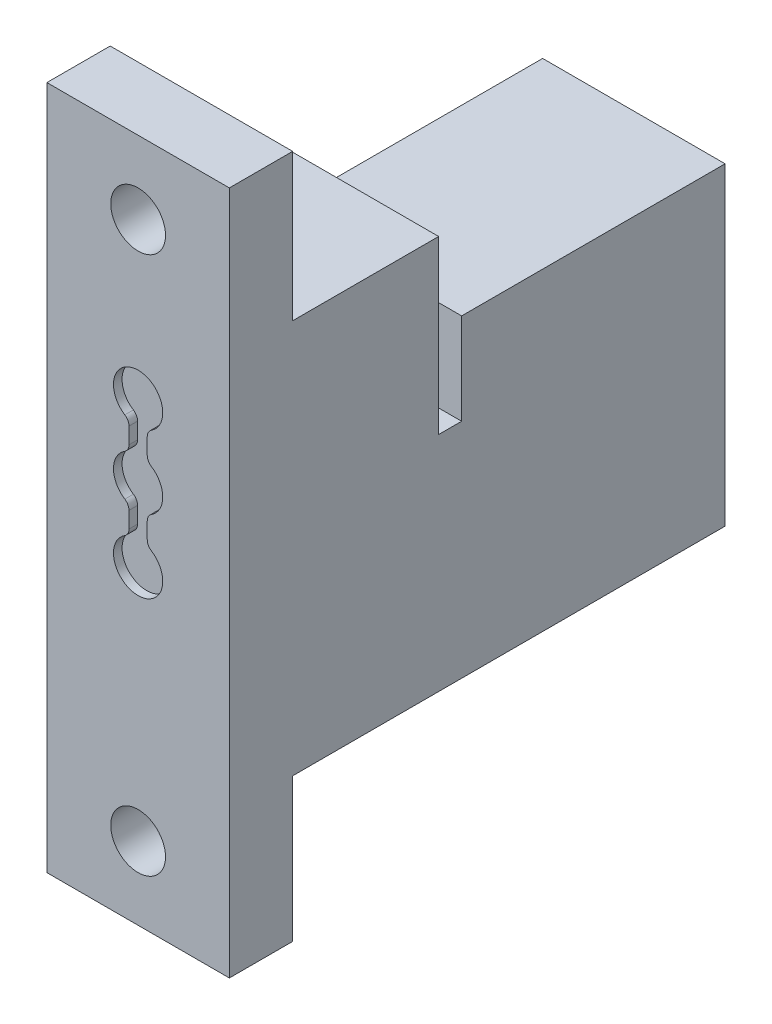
ISO-10303-21;
HEADER;
FILE_DESCRIPTION(('STEP AP214'),'2;1');
FILE_NAME('part.step','',(''),(''),'','','');
FILE_SCHEMA(('AUTOMOTIVE_DESIGN { 1 0 10303 214 1 1 1 1 }'));
ENDSEC;
DATA;
#1=APPLICATION_CONTEXT('core data for automotive mechanical design processes');
#2=APPLICATION_PROTOCOL_DEFINITION('international standard','automotive_design',2000,#1);
#3=PRODUCT_CONTEXT('',#1,'mechanical');
#4=PRODUCT('Part','Part','',(#3));
#5=PRODUCT_RELATED_PRODUCT_CATEGORY('part','',(#4));
#6=PRODUCT_DEFINITION_FORMATION('','',#4);
#7=PRODUCT_DEFINITION_CONTEXT('part definition',#1,'design');
#8=PRODUCT_DEFINITION('design','',#6,#7);
#9=PRODUCT_DEFINITION_SHAPE('','',#8);
#10=(LENGTH_UNIT() NAMED_UNIT(*) SI_UNIT(.MILLI.,.METRE.));
#11=(NAMED_UNIT(*) PLANE_ANGLE_UNIT() SI_UNIT($,.RADIAN.));
#12=(NAMED_UNIT(*) SI_UNIT($,.STERADIAN.) SOLID_ANGLE_UNIT());
#13=UNCERTAINTY_MEASURE_WITH_UNIT(LENGTH_MEASURE(1.E-05),#10,'distance_accuracy_value','');
#14=(GEOMETRIC_REPRESENTATION_CONTEXT(3) GLOBAL_UNCERTAINTY_ASSIGNED_CONTEXT((#13)) GLOBAL_UNIT_ASSIGNED_CONTEXT((#10,
#11,#12)) REPRESENTATION_CONTEXT('',''));
#15=CARTESIAN_POINT('',(0.,0.,0.));
#16=DIRECTION('',(0.,0.,1.));
#17=DIRECTION('',(1.,0.,0.));
#18=AXIS2_PLACEMENT_3D('',#15,#16,#17);
#19=CARTESIAN_POINT('',(-5.,-17.,-3.47));
#20=DIRECTION('',(0.,0.,1.));
#21=DIRECTION('',(1.,0.,0.));
#22=AXIS2_PLACEMENT_3D('',#19,#20,#21);
#23=PLANE('',#22);
#24=CARTESIAN_POINT('',(0.,16.5,-3.47));
#25=DIRECTION('',(0.,0.,1.));
#26=DIRECTION('',(1.,0.,0.));
#27=AXIS2_PLACEMENT_3D('',#24,#25,#26);
#28=CIRCLE('',#27,1.5);
#29=CARTESIAN_POINT('',(1.5,16.5,-3.47));
#30=VERTEX_POINT('',#29);
#31=EDGE_CURVE('E454',#30,#30,#28,.T.);
#32=ORIENTED_EDGE('',*,*,#31,.T.);
#33=EDGE_LOOP('',(#32));
#34=FACE_BOUND('',#33,.T.);
#35=DIRECTION('',(1.,0.,0.));
#36=VECTOR('',#35,1.);
#37=CARTESIAN_POINT('',(5.00000000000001,12.46,-3.47));
#38=LINE('',#37,#36);
#39=CARTESIAN_POINT('',(-5.,12.46,-3.47));
#40=VERTEX_POINT('',#39);
#41=CARTESIAN_POINT('',(5.,12.46,-3.47));
#42=VERTEX_POINT('',#41);
#43=EDGE_CURVE('E395',#40,#42,#38,.T.);
#44=ORIENTED_EDGE('',*,*,#43,.F.);
#45=DIRECTION('',(0.,-1.,0.));
#46=VECTOR('',#45,1.);
#47=CARTESIAN_POINT('',(-5.,20.5,-3.47));
#48=LINE('',#47,#46);
#49=CARTESIAN_POINT('',(-5.,20.5,-3.47));
#50=VERTEX_POINT('',#49);
#51=EDGE_CURVE('E467',#50,#40,#48,.T.);
#52=ORIENTED_EDGE('',*,*,#51,.F.);
#53=DIRECTION('',(-1.,0.,0.));
#54=VECTOR('',#53,1.);
#55=CARTESIAN_POINT('',(-5.,20.5,-3.47));
#56=LINE('',#55,#54);
#57=CARTESIAN_POINT('',(5.,20.5,-3.47));
#58=VERTEX_POINT('',#57);
#59=EDGE_CURVE('E473',#58,#50,#56,.T.);
#60=ORIENTED_EDGE('',*,*,#59,.F.);
#61=DIRECTION('',(0.,1.,0.));
#62=VECTOR('',#61,1.);
#63=CARTESIAN_POINT('',(5.,20.5,-3.47));
#64=LINE('',#63,#62);
#65=EDGE_CURVE('E62',#42,#58,#64,.T.);
#66=ORIENTED_EDGE('',*,*,#65,.F.);
#67=EDGE_LOOP('',(#44,#52,#60,#66));
#68=FACE_BOUND('',#67,.T.);
#69=ADVANCED_FACE('F37',(#34,#68),#23,.F.);
#70=CARTESIAN_POINT('',(0.,-13.,-3.47));
#71=DIRECTION('',(0.,0.,1.));
#72=DIRECTION('',(1.,0.,0.));
#73=AXIS2_PLACEMENT_3D('',#70,#71,#72);
#74=CIRCLE('',#73,1.5);
#75=CARTESIAN_POINT('',(1.5,-13.,-3.47));
#76=VERTEX_POINT('',#75);
#77=EDGE_CURVE('E427',#76,#76,#74,.T.);
#78=ORIENTED_EDGE('',*,*,#77,.T.);
#79=EDGE_LOOP('',(#78));
#80=FACE_BOUND('',#79,.T.);
#81=DIRECTION('',(-1.,0.,0.));
#82=VECTOR('',#81,1.);
#83=CARTESIAN_POINT('',(5.,-9.14,-3.47));
#84=LINE('',#83,#82);
#85=CARTESIAN_POINT('',(5.,-9.14,-3.47));
#86=VERTEX_POINT('',#85);
#87=CARTESIAN_POINT('',(-5.,-9.14,-3.47));
#88=VERTEX_POINT('',#87);
#89=EDGE_CURVE('E405',#86,#88,#84,.T.);
#90=ORIENTED_EDGE('',*,*,#89,.F.);
#91=CARTESIAN_POINT('',(5.,-17.,-3.47));
#92=VERTEX_POINT('',#91);
#93=EDGE_CURVE('E488',#92,#86,#64,.T.);
#94=ORIENTED_EDGE('',*,*,#93,.F.);
#95=DIRECTION('',(1.,0.,0.));
#96=VECTOR('',#95,1.);
#97=CARTESIAN_POINT('',(-5.,-17.,-3.47));
#98=LINE('',#97,#96);
#99=CARTESIAN_POINT('',(-5.,-17.,-3.47));
#100=VERTEX_POINT('',#99);
#101=EDGE_CURVE('E462',#100,#92,#98,.T.);
#102=ORIENTED_EDGE('',*,*,#101,.F.);
#103=EDGE_CURVE('E465',#88,#100,#48,.T.);
#104=ORIENTED_EDGE('',*,*,#103,.F.);
#105=EDGE_LOOP('',(#90,#94,#102,#104));
#106=FACE_BOUND('',#105,.T.);
#107=ADVANCED_FACE('F503',(#80,#106),#23,.F.);
#108=CARTESIAN_POINT('',(-5.,20.5,-3.47));
#109=DIRECTION('',(-1.,0.,0.));
#110=DIRECTION('',(0.,0.,1.));
#111=AXIS2_PLACEMENT_3D('',#108,#109,#110);
#112=PLANE('',#111);
#113=DIRECTION('',(0.,1.,0.));
#114=VECTOR('',#113,1.);
#115=CARTESIAN_POINT('',(-5.,3.06,-12.73));
#116=LINE('',#115,#114);
#117=CARTESIAN_POINT('',(-5.,3.06,-12.73));
#118=VERTEX_POINT('',#117);
#119=CARTESIAN_POINT('',(-5.,8.06,-12.73));
#120=VERTEX_POINT('',#119);
#121=EDGE_CURVE('E371',#118,#120,#116,.T.);
#122=ORIENTED_EDGE('',*,*,#121,.T.);
#123=DIRECTION('',(0.,0.,1.));
#124=VECTOR('',#123,1.);
#125=CARTESIAN_POINT('',(-5.,8.06,-27.17));
#126=LINE('',#125,#124);
#127=CARTESIAN_POINT('',(-5.,8.06,-27.17));
#128=VERTEX_POINT('',#127);
#129=EDGE_CURVE('E402',#128,#120,#126,.T.);
#130=ORIENTED_EDGE('',*,*,#129,.F.);
#131=DIRECTION('',(0.,1.,0.));
#132=VECTOR('',#131,1.);
#133=CARTESIAN_POINT('',(-5.,8.06,-27.17));
#134=LINE('',#133,#132);
#135=CARTESIAN_POINT('',(-5.,-9.14,-27.17));
#136=VERTEX_POINT('',#135);
#137=EDGE_CURVE('E381',#136,#128,#134,.T.);
#138=ORIENTED_EDGE('',*,*,#137,.F.);
#139=DIRECTION('',(0.,0.,1.));
#140=VECTOR('',#139,1.);
#141=CARTESIAN_POINT('',(-5.,-9.14,-11.47));
#142=LINE('',#141,#140);
#143=EDGE_CURVE('E421',#136,#88,#142,.T.);
#144=ORIENTED_EDGE('',*,*,#143,.T.);
#145=ORIENTED_EDGE('',*,*,#103,.T.);
#146=DIRECTION('',(0.,0.,1.));
#147=VECTOR('',#146,1.);
#148=CARTESIAN_POINT('',(-5.,-17.,-3.47));
#149=LINE('',#148,#147);
#150=CARTESIAN_POINT('',(-5.,-17.,0.));
#151=VERTEX_POINT('',#150);
#152=EDGE_CURVE('E470',#100,#151,#149,.T.);
#153=ORIENTED_EDGE('',*,*,#152,.T.);
#154=DIRECTION('',(0.,-1.,0.));
#155=VECTOR('',#154,1.);
#156=CARTESIAN_POINT('',(-5.,20.5,0.));
#157=LINE('',#156,#155);
#158=CARTESIAN_POINT('',(-5.,20.5,0.));
#159=VERTEX_POINT('',#158);
#160=EDGE_CURVE('E457',#159,#151,#157,.T.);
#161=ORIENTED_EDGE('',*,*,#160,.F.);
#162=DIRECTION('',(0.,0.,1.));
#163=VECTOR('',#162,1.);
#164=CARTESIAN_POINT('',(-5.,20.5,-3.47));
#165=LINE('',#164,#163);
#166=EDGE_CURVE('E11',#50,#159,#165,.T.);
#167=ORIENTED_EDGE('',*,*,#166,.F.);
#168=ORIENTED_EDGE('',*,*,#51,.T.);
#169=DIRECTION('',(0.,0.,1.));
#170=VECTOR('',#169,1.);
#171=CARTESIAN_POINT('',(-5.,12.46,-11.47));
#172=LINE('',#171,#170);
#173=CARTESIAN_POINT('',(-5.,12.46,-11.47));
#174=VERTEX_POINT('',#173);
#175=EDGE_CURVE('E436',#174,#40,#172,.T.);
#176=ORIENTED_EDGE('',*,*,#175,.F.);
#177=DIRECTION('',(0.,1.,0.));
#178=VECTOR('',#177,1.);
#179=CARTESIAN_POINT('',(-5.,12.46,-11.47));
#180=LINE('',#179,#178);
#181=CARTESIAN_POINT('',(-5.,3.06,-11.47));
#182=VERTEX_POINT('',#181);
#183=EDGE_CURVE('E394',#182,#174,#180,.T.);
#184=ORIENTED_EDGE('',*,*,#183,.F.);
#185=DIRECTION('',(0.,0.,1.));
#186=VECTOR('',#185,1.);
#187=CARTESIAN_POINT('',(-5.,3.06,-12.73));
#188=LINE('',#187,#186);
#189=EDGE_CURVE('E358',#118,#182,#188,.T.);
#190=ORIENTED_EDGE('',*,*,#189,.F.);
#191=EDGE_LOOP('',(#122,#130,#138,#144,#145,#153,#161,#167,#168,#176,#184,#190));
#192=FACE_BOUND('',#191,.T.);
#193=ADVANCED_FACE('F39',(#192),#112,.T.);
#194=CARTESIAN_POINT('',(-5.,20.5,-3.47));
#195=DIRECTION('',(0.,1.,0.));
#196=DIRECTION('',(0.,0.,1.));
#197=AXIS2_PLACEMENT_3D('',#194,#195,#196);
#198=PLANE('',#197);
#199=DIRECTION('',(-1.,0.,0.));
#200=VECTOR('',#199,1.);
#201=CARTESIAN_POINT('',(-5.,20.5,0.));
#202=LINE('',#201,#200);
#203=CARTESIAN_POINT('',(5.,20.5,0.));
#204=VERTEX_POINT('',#203);
#205=EDGE_CURVE('E476',#204,#159,#202,.T.);
#206=ORIENTED_EDGE('',*,*,#205,.F.);
#207=DIRECTION('',(0.,0.,1.));
#208=VECTOR('',#207,1.);
#209=CARTESIAN_POINT('',(5.,20.5,-3.47));
#210=LINE('',#209,#208);
#211=EDGE_CURVE('E46',#58,#204,#210,.T.);
#212=ORIENTED_EDGE('',*,*,#211,.F.);
#213=ORIENTED_EDGE('',*,*,#59,.T.);
#214=ORIENTED_EDGE('',*,*,#166,.T.);
#215=EDGE_LOOP('',(#206,#212,#213,#214));
#216=FACE_BOUND('',#215,.T.);
#217=ADVANCED_FACE('F509',(#216),#198,.T.);
#218=CARTESIAN_POINT('',(5.,20.5,-3.47));
#219=DIRECTION('',(1.,0.,0.));
#220=DIRECTION('',(0.,0.,-1.));
#221=AXIS2_PLACEMENT_3D('',#218,#219,#220);
#222=PLANE('',#221);
#223=DIRECTION('',(0.,1.,0.));
#224=VECTOR('',#223,1.);
#225=CARTESIAN_POINT('',(5.00000000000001,3.06,-12.73));
#226=LINE('',#225,#224);
#227=CARTESIAN_POINT('',(5.00000000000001,3.06,-12.73));
#228=VERTEX_POINT('',#227);
#229=CARTESIAN_POINT('',(5.00000000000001,8.06,-12.73));
#230=VERTEX_POINT('',#229);
#231=EDGE_CURVE('E369',#228,#230,#226,.T.);
#232=ORIENTED_EDGE('',*,*,#231,.F.);
#233=DIRECTION('',(0.,0.,-1.));
#234=VECTOR('',#233,1.);
#235=CARTESIAN_POINT('',(5.00000000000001,3.06,-12.73));
#236=LINE('',#235,#234);
#237=CARTESIAN_POINT('',(5.00000000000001,3.06,-11.47));
#238=VERTEX_POINT('',#237);
#239=EDGE_CURVE('E364',#238,#228,#236,.T.);
#240=ORIENTED_EDGE('',*,*,#239,.F.);
#241=DIRECTION('',(0.,-1.,0.));
#242=VECTOR('',#241,1.);
#243=CARTESIAN_POINT('',(5.00000000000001,12.46,-11.47));
#244=LINE('',#243,#242);
#245=CARTESIAN_POINT('',(5.00000000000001,12.46,-11.47));
#246=VERTEX_POINT('',#245);
#247=EDGE_CURVE('E391',#246,#238,#244,.T.);
#248=ORIENTED_EDGE('',*,*,#247,.F.);
#249=DIRECTION('',(0.,0.,1.));
#250=VECTOR('',#249,1.);
#251=CARTESIAN_POINT('',(5.00000000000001,12.46,-11.47));
#252=LINE('',#251,#250);
#253=EDGE_CURVE('E433',#246,#42,#252,.T.);
#254=ORIENTED_EDGE('',*,*,#253,.T.);
#255=ORIENTED_EDGE('',*,*,#65,.T.);
#256=ORIENTED_EDGE('',*,*,#211,.T.);
#257=DIRECTION('',(0.,1.,0.));
#258=VECTOR('',#257,1.);
#259=CARTESIAN_POINT('',(5.,20.5,0.));
#260=LINE('',#259,#258);
#261=CARTESIAN_POINT('',(5.,-17.,0.));
#262=VERTEX_POINT('',#261);
#263=EDGE_CURVE('E479',#262,#204,#260,.T.);
#264=ORIENTED_EDGE('',*,*,#263,.F.);
#265=DIRECTION('',(0.,0.,1.));
#266=VECTOR('',#265,1.);
#267=CARTESIAN_POINT('',(5.,-17.,-3.47));
#268=LINE('',#267,#266);
#269=EDGE_CURVE('E472',#92,#262,#268,.T.);
#270=ORIENTED_EDGE('',*,*,#269,.F.);
#271=ORIENTED_EDGE('',*,*,#93,.T.);
#272=DIRECTION('',(0.,0.,1.));
#273=VECTOR('',#272,1.);
#274=CARTESIAN_POINT('',(5.,-9.14,-11.47));
#275=LINE('',#274,#273);
#276=CARTESIAN_POINT('',(5.,-9.14,-27.17));
#277=VERTEX_POINT('',#276);
#278=EDGE_CURVE('E442',#277,#86,#275,.T.);
#279=ORIENTED_EDGE('',*,*,#278,.F.);
#280=DIRECTION('',(0.,-1.,0.));
#281=VECTOR('',#280,1.);
#282=CARTESIAN_POINT('',(5.00000000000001,8.06,-27.17));
#283=LINE('',#282,#281);
#284=CARTESIAN_POINT('',(5.00000000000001,8.06,-27.17));
#285=VERTEX_POINT('',#284);
#286=EDGE_CURVE('E374',#285,#277,#283,.T.);
#287=ORIENTED_EDGE('',*,*,#286,.F.);
#288=DIRECTION('',(0.,0.,1.));
#289=VECTOR('',#288,1.);
#290=CARTESIAN_POINT('',(5.00000000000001,8.06,-27.17));
#291=LINE('',#290,#289);
#292=EDGE_CURVE('E385',#285,#230,#291,.T.);
#293=ORIENTED_EDGE('',*,*,#292,.T.);
#294=EDGE_LOOP('',(#232,#240,#248,#254,#255,#256,#264,#270,#271,#279,#287,#293));
#295=FACE_BOUND('',#294,.T.);
#296=ADVANCED_FACE('F515',(#295),#222,.T.);
#297=CARTESIAN_POINT('',(-5.,-17.,-3.47));
#298=DIRECTION('',(0.,-1.,0.));
#299=DIRECTION('',(0.,0.,-1.));
#300=AXIS2_PLACEMENT_3D('',#297,#298,#299);
#301=PLANE('',#300);
#302=DIRECTION('',(1.,0.,0.));
#303=VECTOR('',#302,1.);
#304=CARTESIAN_POINT('',(-5.,-17.,0.));
#305=LINE('',#304,#303);
#306=EDGE_CURVE('E482',#151,#262,#305,.T.);
#307=ORIENTED_EDGE('',*,*,#306,.F.);
#308=ORIENTED_EDGE('',*,*,#152,.F.);
#309=ORIENTED_EDGE('',*,*,#101,.T.);
#310=ORIENTED_EDGE('',*,*,#269,.T.);
#311=EDGE_LOOP('',(#307,#308,#309,#310));
#312=FACE_BOUND('',#311,.T.);
#313=ADVANCED_FACE('F500',(#312),#301,.T.);
#314=CARTESIAN_POINT('',(-5.,-17.,0.));
#315=DIRECTION('',(0.,0.,1.));
#316=DIRECTION('',(1.,0.,0.));
#317=AXIS2_PLACEMENT_3D('',#314,#315,#316);
#318=PLANE('',#317);
#319=CARTESIAN_POINT('',(1.,6.44356175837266,0.));
#320=DIRECTION('',(0.,0.,-1.));
#321=DIRECTION('',(1.,0.,0.));
#322=AXIS2_PLACEMENT_3D('',#319,#320,#321);
#323=CIRCLE('',#322,0.5);
#324=CARTESIAN_POINT('',(0.5,6.44356175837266,0.));
#325=VERTEX_POINT('',#324);
#326=CARTESIAN_POINT('',(0.729729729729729,6.86422074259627,0.));
#327=VERTEX_POINT('',#326);
#328=EDGE_CURVE('E54',#325,#327,#323,.T.);
#329=ORIENTED_EDGE('',*,*,#328,.F.);
#330=DIRECTION('',(0.,1.,0.));
#331=VECTOR('',#330,1.);
#332=CARTESIAN_POINT('',(0.5,6.44356175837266,0.));
#333=LINE('',#332,#331);
#334=CARTESIAN_POINT('',(0.5,5.55643824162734,0.));
#335=VERTEX_POINT('',#334);
#336=EDGE_CURVE('E244',#335,#325,#333,.T.);
#337=ORIENTED_EDGE('',*,*,#336,.F.);
#338=CARTESIAN_POINT('',(1.,5.55643824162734,0.));
#339=DIRECTION('',(0.,0.,-1.));
#340=DIRECTION('',(1.,0.,0.));
#341=AXIS2_PLACEMENT_3D('',#338,#339,#340);
#342=CIRCLE('',#341,0.5);
#343=CARTESIAN_POINT('',(0.72972972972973,5.13577925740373,0.));
#344=VERTEX_POINT('',#343);
#345=EDGE_CURVE('E247',#344,#335,#342,.T.);
#346=ORIENTED_EDGE('',*,*,#345,.F.);
#347=CARTESIAN_POINT('',(0.,4.,0.));
#348=DIRECTION('',(0.,0.,1.));
#349=DIRECTION('',(1.,0.,0.));
#350=AXIS2_PLACEMENT_3D('',#347,#348,#349);
#351=CIRCLE('',#350,1.35);
#352=CARTESIAN_POINT('',(0.72972972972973,2.86422074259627,0.));
#353=VERTEX_POINT('',#352);
#354=EDGE_CURVE('E323',#353,#344,#351,.T.);
#355=ORIENTED_EDGE('',*,*,#354,.F.);
#356=CARTESIAN_POINT('',(1.,2.44356175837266,0.));
#357=DIRECTION('',(0.,0.,-1.));
#358=DIRECTION('',(1.,0.,0.));
#359=AXIS2_PLACEMENT_3D('',#356,#357,#358);
#360=CIRCLE('',#359,0.5);
#361=CARTESIAN_POINT('',(0.500000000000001,2.44356175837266,0.));
#362=VERTEX_POINT('',#361);
#363=EDGE_CURVE('E320',#362,#353,#360,.T.);
#364=ORIENTED_EDGE('',*,*,#363,.F.);
#365=DIRECTION('',(0.,1.,0.));
#366=VECTOR('',#365,1.);
#367=CARTESIAN_POINT('',(0.500000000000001,2.44356175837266,0.));
#368=LINE('',#367,#366);
#369=CARTESIAN_POINT('',(0.500000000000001,1.55643824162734,0.));
#370=VERTEX_POINT('',#369);
#371=EDGE_CURVE('E317',#370,#362,#368,.T.);
#372=ORIENTED_EDGE('',*,*,#371,.F.);
#373=CARTESIAN_POINT('',(1.,1.55643824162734,0.));
#374=DIRECTION('',(0.,0.,-1.));
#375=DIRECTION('',(1.,0.,0.));
#376=AXIS2_PLACEMENT_3D('',#373,#374,#375);
#377=CIRCLE('',#376,0.5);
#378=CARTESIAN_POINT('',(0.72972972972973,1.13577925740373,0.));
#379=VERTEX_POINT('',#378);
#380=EDGE_CURVE('E314',#379,#370,#377,.T.);
#381=ORIENTED_EDGE('',*,*,#380,.F.);
#382=CARTESIAN_POINT('',(0.,0.,0.));
#383=DIRECTION('',(0.,0.,1.));
#384=DIRECTION('',(1.,0.,0.));
#385=AXIS2_PLACEMENT_3D('',#382,#383,#384);
#386=CIRCLE('',#385,1.35);
#387=CARTESIAN_POINT('',(-0.72972972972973,1.13577925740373,0.));
#388=VERTEX_POINT('',#387);
#389=EDGE_CURVE('E311',#388,#379,#386,.T.);
#390=ORIENTED_EDGE('',*,*,#389,.F.);
#391=CARTESIAN_POINT('',(-1.,1.55643824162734,0.));
#392=DIRECTION('',(0.,0.,-1.));
#393=DIRECTION('',(1.,0.,0.));
#394=AXIS2_PLACEMENT_3D('',#391,#392,#393);
#395=CIRCLE('',#394,0.5);
#396=CARTESIAN_POINT('',(-0.5,1.55643824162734,0.));
#397=VERTEX_POINT('',#396);
#398=EDGE_CURVE('E308',#397,#388,#395,.T.);
#399=ORIENTED_EDGE('',*,*,#398,.F.);
#400=DIRECTION('',(0.,-1.,0.));
#401=VECTOR('',#400,1.);
#402=CARTESIAN_POINT('',(-0.500000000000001,2.44356175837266,0.));
#403=LINE('',#402,#401);
#404=CARTESIAN_POINT('',(-0.500000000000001,2.44356175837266,0.));
#405=VERTEX_POINT('',#404);
#406=EDGE_CURVE('E305',#405,#397,#403,.T.);
#407=ORIENTED_EDGE('',*,*,#406,.F.);
#408=CARTESIAN_POINT('',(-1.,2.44356175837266,0.));
#409=DIRECTION('',(0.,0.,-1.));
#410=DIRECTION('',(1.,0.,0.));
#411=AXIS2_PLACEMENT_3D('',#408,#409,#410);
#412=CIRCLE('',#411,0.5);
#413=CARTESIAN_POINT('',(-0.72972972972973,2.86422074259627,0.));
#414=VERTEX_POINT('',#413);
#415=EDGE_CURVE('E302',#414,#405,#412,.T.);
#416=ORIENTED_EDGE('',*,*,#415,.F.);
#417=CARTESIAN_POINT('',(0.,4.,0.));
#418=DIRECTION('',(0.,0.,1.));
#419=DIRECTION('',(1.,0.,0.));
#420=AXIS2_PLACEMENT_3D('',#417,#418,#419);
#421=CIRCLE('',#420,1.35);
#422=CARTESIAN_POINT('',(-0.72972972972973,5.13577925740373,0.));
#423=VERTEX_POINT('',#422);
#424=EDGE_CURVE('E299',#423,#414,#421,.T.);
#425=ORIENTED_EDGE('',*,*,#424,.F.);
#426=CARTESIAN_POINT('',(-1.,5.55643824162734,0.));
#427=DIRECTION('',(0.,0.,-1.));
#428=DIRECTION('',(1.,0.,0.));
#429=AXIS2_PLACEMENT_3D('',#426,#427,#428);
#430=CIRCLE('',#429,0.5);
#431=CARTESIAN_POINT('',(-0.5,5.55643824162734,0.));
#432=VERTEX_POINT('',#431);
#433=EDGE_CURVE('E296',#432,#423,#430,.T.);
#434=ORIENTED_EDGE('',*,*,#433,.F.);
#435=DIRECTION('',(0.,-1.,0.));
#436=VECTOR('',#435,1.);
#437=CARTESIAN_POINT('',(-0.5,6.44356175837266,0.));
#438=LINE('',#437,#436);
#439=CARTESIAN_POINT('',(-0.5,6.44356175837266,0.));
#440=VERTEX_POINT('',#439);
#441=EDGE_CURVE('E293',#440,#432,#438,.T.);
#442=ORIENTED_EDGE('',*,*,#441,.F.);
#443=CARTESIAN_POINT('',(-1.,6.44356175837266,0.));
#444=DIRECTION('',(0.,0.,-1.));
#445=DIRECTION('',(1.,0.,0.));
#446=AXIS2_PLACEMENT_3D('',#443,#444,#445);
#447=CIRCLE('',#446,0.5);
#448=CARTESIAN_POINT('',(-0.729729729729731,6.86422074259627,0.));
#449=VERTEX_POINT('',#448);
#450=EDGE_CURVE('E290',#449,#440,#447,.T.);
#451=ORIENTED_EDGE('',*,*,#450,.F.);
#452=CARTESIAN_POINT('',(0.,8.,0.));
#453=DIRECTION('',(0.,0.,1.));
#454=DIRECTION('',(1.,0.,0.));
#455=AXIS2_PLACEMENT_3D('',#452,#453,#454);
#456=CIRCLE('',#455,1.35);
#457=EDGE_CURVE('E288',#327,#449,#456,.T.);
#458=ORIENTED_EDGE('',*,*,#457,.F.);
#459=EDGE_LOOP('',(#329,#337,#346,#355,#364,#372,#381,#390,#399,#407,#416,#425,#434,#442,#451,#458));
#460=FACE_BOUND('',#459,.T.);
#461=CARTESIAN_POINT('',(0.,-13.,0.));
#462=DIRECTION('',(0.,0.,1.));
#463=DIRECTION('',(1.,0.,0.));
#464=AXIS2_PLACEMENT_3D('',#461,#462,#463);
#465=CIRCLE('',#464,1.5);
#466=CARTESIAN_POINT('',(1.5,-13.,0.));
#467=VERTEX_POINT('',#466);
#468=EDGE_CURVE('E445',#467,#467,#465,.T.);
#469=ORIENTED_EDGE('',*,*,#468,.F.);
#470=EDGE_LOOP('',(#469));
#471=FACE_BOUND('',#470,.T.);
#472=CARTESIAN_POINT('',(0.,16.5,0.));
#473=DIRECTION('',(0.,0.,1.));
#474=DIRECTION('',(1.,0.,0.));
#475=AXIS2_PLACEMENT_3D('',#472,#473,#474);
#476=CIRCLE('',#475,1.5);
#477=CARTESIAN_POINT('',(1.5,16.5,0.));
#478=VERTEX_POINT('',#477);
#479=EDGE_CURVE('E452',#478,#478,#476,.T.);
#480=ORIENTED_EDGE('',*,*,#479,.F.);
#481=EDGE_LOOP('',(#480));
#482=FACE_BOUND('',#481,.T.);
#483=ORIENTED_EDGE('',*,*,#160,.T.);
#484=ORIENTED_EDGE('',*,*,#306,.T.);
#485=ORIENTED_EDGE('',*,*,#263,.T.);
#486=ORIENTED_EDGE('',*,*,#205,.T.);
#487=EDGE_LOOP('',(#483,#484,#485,#486));
#488=FACE_BOUND('',#487,.T.);
#489=ADVANCED_FACE('F506',(#460,#471,#482,#488),#318,.T.);
#490=CARTESIAN_POINT('',(0.,16.5,-3.47));
#491=DIRECTION('',(0.,0.,1.));
#492=DIRECTION('',(1.,0.,0.));
#493=AXIS2_PLACEMENT_3D('',#490,#491,#492);
#494=CYLINDRICAL_SURFACE('',#493,1.5);
#495=ORIENTED_EDGE('',*,*,#31,.F.);
#496=EDGE_LOOP('',(#495));
#497=FACE_BOUND('',#496,.T.);
#498=ORIENTED_EDGE('',*,*,#479,.T.);
#499=EDGE_LOOP('',(#498));
#500=FACE_BOUND('',#499,.T.);
#501=ADVANCED_FACE('F540',(#497,#500),#494,.F.);
#502=CARTESIAN_POINT('',(0.,-13.,-3.47));
#503=DIRECTION('',(0.,0.,1.));
#504=DIRECTION('',(1.,0.,0.));
#505=AXIS2_PLACEMENT_3D('',#502,#503,#504);
#506=CYLINDRICAL_SURFACE('',#505,1.5);
#507=ORIENTED_EDGE('',*,*,#77,.F.);
#508=EDGE_LOOP('',(#507));
#509=FACE_BOUND('',#508,.T.);
#510=ORIENTED_EDGE('',*,*,#468,.T.);
#511=EDGE_LOOP('',(#510));
#512=FACE_BOUND('',#511,.T.);
#513=ADVANCED_FACE('F533',(#509,#512),#506,.F.);
#514=CARTESIAN_POINT('',(5.,-9.14,-11.47));
#515=DIRECTION('',(0.,1.,0.));
#516=DIRECTION('',(-1.,0.,0.));
#517=AXIS2_PLACEMENT_3D('',#514,#515,#516);
#518=PLANE('',#517);
#519=ORIENTED_EDGE('',*,*,#89,.T.);
#520=ORIENTED_EDGE('',*,*,#143,.F.);
#521=DIRECTION('',(-1.,0.,0.));
#522=VECTOR('',#521,1.);
#523=CARTESIAN_POINT('',(5.,-9.14,-27.17));
#524=LINE('',#523,#522);
#525=EDGE_CURVE('E378',#277,#136,#524,.T.);
#526=ORIENTED_EDGE('',*,*,#525,.F.);
#527=ORIENTED_EDGE('',*,*,#278,.T.);
#528=EDGE_LOOP('',(#519,#520,#526,#527));
#529=FACE_BOUND('',#528,.T.);
#530=ADVANCED_FACE('F531',(#529),#518,.F.);
#531=CARTESIAN_POINT('',(5.00000000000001,12.46,-11.47));
#532=DIRECTION('',(0.,-1.,0.));
#533=DIRECTION('',(1.,0.,0.));
#534=AXIS2_PLACEMENT_3D('',#531,#532,#533);
#535=PLANE('',#534);
#536=ORIENTED_EDGE('',*,*,#43,.T.);
#537=ORIENTED_EDGE('',*,*,#253,.F.);
#538=DIRECTION('',(1.,0.,0.));
#539=VECTOR('',#538,1.);
#540=CARTESIAN_POINT('',(5.00000000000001,12.46,-11.47));
#541=LINE('',#540,#539);
#542=EDGE_CURVE('E399',#174,#246,#541,.T.);
#543=ORIENTED_EDGE('',*,*,#542,.F.);
#544=ORIENTED_EDGE('',*,*,#175,.T.);
#545=EDGE_LOOP('',(#536,#537,#543,#544));
#546=FACE_BOUND('',#545,.T.);
#547=ADVANCED_FACE('F512',(#546),#535,.F.);
#548=CARTESIAN_POINT('',(5.,-9.14,-11.47));
#549=DIRECTION('',(0.,0.,-1.));
#550=DIRECTION('',(-1.,0.,0.));
#551=AXIS2_PLACEMENT_3D('',#548,#549,#550);
#552=PLANE('',#551);
#553=ORIENTED_EDGE('',*,*,#247,.T.);
#554=DIRECTION('',(1.,0.,0.));
#555=VECTOR('',#554,1.);
#556=CARTESIAN_POINT('',(-5.,3.06,-11.47));
#557=LINE('',#556,#555);
#558=EDGE_CURVE('E361',#182,#238,#557,.T.);
#559=ORIENTED_EDGE('',*,*,#558,.F.);
#560=ORIENTED_EDGE('',*,*,#183,.T.);
#561=ORIENTED_EDGE('',*,*,#542,.T.);
#562=EDGE_LOOP('',(#553,#559,#560,#561));
#563=FACE_BOUND('',#562,.T.);
#564=ADVANCED_FACE('F519',(#563),#552,.T.);
#565=CARTESIAN_POINT('',(5.00000000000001,8.06,-27.17));
#566=DIRECTION('',(0.,-1.,0.));
#567=DIRECTION('',(0.,0.,-1.));
#568=AXIS2_PLACEMENT_3D('',#565,#566,#567);
#569=PLANE('',#568);
#570=ORIENTED_EDGE('',*,*,#129,.T.);
#571=DIRECTION('',(-1.,0.,0.));
#572=VECTOR('',#571,1.);
#573=CARTESIAN_POINT('',(-5.,8.06,-12.73));
#574=LINE('',#573,#572);
#575=EDGE_CURVE('E330',#230,#120,#574,.T.);
#576=ORIENTED_EDGE('',*,*,#575,.F.);
#577=ORIENTED_EDGE('',*,*,#292,.F.);
#578=DIRECTION('',(1.,0.,0.));
#579=VECTOR('',#578,1.);
#580=CARTESIAN_POINT('',(5.00000000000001,8.06,-27.17));
#581=LINE('',#580,#579);
#582=EDGE_CURVE('E383',#128,#285,#581,.T.);
#583=ORIENTED_EDGE('',*,*,#582,.F.);
#584=EDGE_LOOP('',(#570,#576,#577,#583));
#585=FACE_BOUND('',#584,.T.);
#586=ADVANCED_FACE('F527',(#585),#569,.F.);
#587=CARTESIAN_POINT('',(5.,-9.14,-27.17));
#588=DIRECTION('',(0.,0.,-1.));
#589=DIRECTION('',(-1.,0.,0.));
#590=AXIS2_PLACEMENT_3D('',#587,#588,#589);
#591=PLANE('',#590);
#592=ORIENTED_EDGE('',*,*,#286,.T.);
#593=ORIENTED_EDGE('',*,*,#525,.T.);
#594=ORIENTED_EDGE('',*,*,#137,.T.);
#595=ORIENTED_EDGE('',*,*,#582,.T.);
#596=EDGE_LOOP('',(#592,#593,#594,#595));
#597=FACE_BOUND('',#596,.T.);
#598=ADVANCED_FACE('F530',(#597),#591,.T.);
#599=CARTESIAN_POINT('',(-5.,3.06,-12.73));
#600=DIRECTION('',(0.,0.,-1.));
#601=DIRECTION('',(-1.,0.,0.));
#602=AXIS2_PLACEMENT_3D('',#599,#600,#601);
#603=PLANE('',#602);
#604=ORIENTED_EDGE('',*,*,#575,.T.);
#605=ORIENTED_EDGE('',*,*,#121,.F.);
#606=DIRECTION('',(-1.,0.,0.));
#607=VECTOR('',#606,1.);
#608=CARTESIAN_POINT('',(-5.,3.06,-12.73));
#609=LINE('',#608,#607);
#610=EDGE_CURVE('E366',#228,#118,#609,.T.);
#611=ORIENTED_EDGE('',*,*,#610,.F.);
#612=ORIENTED_EDGE('',*,*,#231,.T.);
#613=EDGE_LOOP('',(#604,#605,#611,#612));
#614=FACE_BOUND('',#613,.T.);
#615=ADVANCED_FACE('F525',(#614),#603,.F.);
#616=CARTESIAN_POINT('',(-5.,3.06,-12.73));
#617=DIRECTION('',(0.,1.,0.));
#618=DIRECTION('',(0.,0.,1.));
#619=AXIS2_PLACEMENT_3D('',#616,#617,#618);
#620=PLANE('',#619);
#621=ORIENTED_EDGE('',*,*,#189,.T.);
#622=ORIENTED_EDGE('',*,*,#558,.T.);
#623=ORIENTED_EDGE('',*,*,#239,.T.);
#624=ORIENTED_EDGE('',*,*,#610,.T.);
#625=EDGE_LOOP('',(#621,#622,#623,#624));
#626=FACE_BOUND('',#625,.T.);
#627=ADVANCED_FACE('F521',(#626),#620,.T.);
#628=CARTESIAN_POINT('',(1.,6.44356175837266,-0.47));
#629=DIRECTION('',(0.,0.,1.));
#630=DIRECTION('',(1.,0.,0.));
#631=AXIS2_PLACEMENT_3D('',#628,#629,#630);
#632=CYLINDRICAL_SURFACE('',#631,0.5);
#633=ORIENTED_EDGE('',*,*,#328,.T.);
#634=DIRECTION('',(0.,0.,1.));
#635=VECTOR('',#634,1.);
#636=CARTESIAN_POINT('',(0.729729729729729,6.86422074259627,-0.47));
#637=LINE('',#636,#635);
#638=CARTESIAN_POINT('',(0.729729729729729,6.86422074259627,-0.47));
#639=VERTEX_POINT('',#638);
#640=EDGE_CURVE('E221',#639,#327,#637,.T.);
#641=ORIENTED_EDGE('',*,*,#640,.F.);
#642=CARTESIAN_POINT('',(1.,6.44356175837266,-0.47));
#643=DIRECTION('',(0.,0.,-1.));
#644=DIRECTION('',(1.,0.,0.));
#645=AXIS2_PLACEMENT_3D('',#642,#643,#644);
#646=CIRCLE('',#645,0.5);
#647=CARTESIAN_POINT('',(0.5,6.44356175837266,-0.47));
#648=VERTEX_POINT('',#647);
#649=EDGE_CURVE('E225',#648,#639,#646,.T.);
#650=ORIENTED_EDGE('',*,*,#649,.F.);
#651=DIRECTION('',(0.,0.,1.));
#652=VECTOR('',#651,1.);
#653=CARTESIAN_POINT('',(0.5,6.44356175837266,-0.47));
#654=LINE('',#653,#652);
#655=EDGE_CURVE('E328',#648,#325,#654,.T.);
#656=ORIENTED_EDGE('',*,*,#655,.T.);
#657=EDGE_LOOP('',(#633,#641,#650,#656));
#658=FACE_BOUND('',#657,.T.);
#659=ADVANCED_FACE('F223',(#658),#632,.T.);
#660=CARTESIAN_POINT('',(0.5,6.44356175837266,-0.47));
#661=DIRECTION('',(1.,0.,0.));
#662=DIRECTION('',(0.,1.,0.));
#663=AXIS2_PLACEMENT_3D('',#660,#661,#662);
#664=PLANE('',#663);
#665=ORIENTED_EDGE('',*,*,#336,.T.);
#666=ORIENTED_EDGE('',*,*,#655,.F.);
#667=DIRECTION('',(0.,1.,0.));
#668=VECTOR('',#667,1.);
#669=CARTESIAN_POINT('',(0.5,6.44356175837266,-0.47));
#670=LINE('',#669,#668);
#671=CARTESIAN_POINT('',(0.5,5.55643824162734,-0.47));
#672=VERTEX_POINT('',#671);
#673=EDGE_CURVE('E231',#672,#648,#670,.T.);
#674=ORIENTED_EDGE('',*,*,#673,.F.);
#675=DIRECTION('',(0.,0.,1.));
#676=VECTOR('',#675,1.);
#677=CARTESIAN_POINT('',(0.5,5.55643824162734,-0.47));
#678=LINE('',#677,#676);
#679=EDGE_CURVE('E331',#672,#335,#678,.T.);
#680=ORIENTED_EDGE('',*,*,#679,.T.);
#681=EDGE_LOOP('',(#665,#666,#674,#680));
#682=FACE_BOUND('',#681,.T.);
#683=ADVANCED_FACE('F662',(#682),#664,.F.);
#684=CARTESIAN_POINT('',(1.,5.55643824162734,-0.47));
#685=DIRECTION('',(0.,0.,1.));
#686=DIRECTION('',(1.,0.,0.));
#687=AXIS2_PLACEMENT_3D('',#684,#685,#686);
#688=CYLINDRICAL_SURFACE('',#687,0.5);
#689=ORIENTED_EDGE('',*,*,#345,.T.);
#690=ORIENTED_EDGE('',*,*,#679,.F.);
#691=CARTESIAN_POINT('',(1.,5.55643824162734,-0.47));
#692=DIRECTION('',(0.,0.,-1.));
#693=DIRECTION('',(1.,0.,0.));
#694=AXIS2_PLACEMENT_3D('',#691,#692,#693);
#695=CIRCLE('',#694,0.5);
#696=CARTESIAN_POINT('',(0.72972972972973,5.13577925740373,-0.47));
#697=VERTEX_POINT('',#696);
#698=EDGE_CURVE('E284',#697,#672,#695,.T.);
#699=ORIENTED_EDGE('',*,*,#698,.F.);
#700=DIRECTION('',(0.,0.,1.));
#701=VECTOR('',#700,1.);
#702=CARTESIAN_POINT('',(0.72972972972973,5.13577925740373,-0.47));
#703=LINE('',#702,#701);
#704=EDGE_CURVE('E333',#697,#344,#703,.T.);
#705=ORIENTED_EDGE('',*,*,#704,.T.);
#706=EDGE_LOOP('',(#689,#690,#699,#705));
#707=FACE_BOUND('',#706,.T.);
#708=ADVANCED_FACE('F668',(#707),#688,.T.);
#709=CARTESIAN_POINT('',(0.,4.,-0.47));
#710=DIRECTION('',(0.,0.,1.));
#711=DIRECTION('',(1.,0.,0.));
#712=AXIS2_PLACEMENT_3D('',#709,#710,#711);
#713=CYLINDRICAL_SURFACE('',#712,1.35);
#714=ORIENTED_EDGE('',*,*,#354,.T.);
#715=ORIENTED_EDGE('',*,*,#704,.F.);
#716=CARTESIAN_POINT('',(0.,4.,-0.47));
#717=DIRECTION('',(0.,0.,1.));
#718=DIRECTION('',(1.,0.,0.));
#719=AXIS2_PLACEMENT_3D('',#716,#717,#718);
#720=CIRCLE('',#719,1.35);
#721=CARTESIAN_POINT('',(0.72972972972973,2.86422074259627,-0.47));
#722=VERTEX_POINT('',#721);
#723=EDGE_CURVE('E281',#722,#697,#720,.T.);
#724=ORIENTED_EDGE('',*,*,#723,.F.);
#725=DIRECTION('',(0.,0.,1.));
#726=VECTOR('',#725,1.);
#727=CARTESIAN_POINT('',(0.72972972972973,2.86422074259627,-0.47));
#728=LINE('',#727,#726);
#729=EDGE_CURVE('E335',#722,#353,#728,.T.);
#730=ORIENTED_EDGE('',*,*,#729,.T.);
#731=EDGE_LOOP('',(#714,#715,#724,#730));
#732=FACE_BOUND('',#731,.T.);
#733=ADVANCED_FACE('F676',(#732),#713,.F.);
#734=CARTESIAN_POINT('',(1.,2.44356175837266,-0.47));
#735=DIRECTION('',(0.,0.,1.));
#736=DIRECTION('',(1.,0.,0.));
#737=AXIS2_PLACEMENT_3D('',#734,#735,#736);
#738=CYLINDRICAL_SURFACE('',#737,0.5);
#739=ORIENTED_EDGE('',*,*,#363,.T.);
#740=ORIENTED_EDGE('',*,*,#729,.F.);
#741=CARTESIAN_POINT('',(1.,2.44356175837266,-0.47));
#742=DIRECTION('',(0.,0.,-1.));
#743=DIRECTION('',(1.,0.,0.));
#744=AXIS2_PLACEMENT_3D('',#741,#742,#743);
#745=CIRCLE('',#744,0.5);
#746=CARTESIAN_POINT('',(0.500000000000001,2.44356175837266,-0.47));
#747=VERTEX_POINT('',#746);
#748=EDGE_CURVE('E278',#747,#722,#745,.T.);
#749=ORIENTED_EDGE('',*,*,#748,.F.);
#750=DIRECTION('',(0.,0.,1.));
#751=VECTOR('',#750,1.);
#752=CARTESIAN_POINT('',(0.500000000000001,2.44356175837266,-0.47));
#753=LINE('',#752,#751);
#754=EDGE_CURVE('E337',#747,#362,#753,.T.);
#755=ORIENTED_EDGE('',*,*,#754,.T.);
#756=EDGE_LOOP('',(#739,#740,#749,#755));
#757=FACE_BOUND('',#756,.T.);
#758=ADVANCED_FACE('F684',(#757),#738,.T.);
#759=CARTESIAN_POINT('',(0.500000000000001,2.44356175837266,-0.47));
#760=DIRECTION('',(1.,0.,0.));
#761=DIRECTION('',(0.,1.,0.));
#762=AXIS2_PLACEMENT_3D('',#759,#760,#761);
#763=PLANE('',#762);
#764=ORIENTED_EDGE('',*,*,#371,.T.);
#765=ORIENTED_EDGE('',*,*,#754,.F.);
#766=DIRECTION('',(0.,1.,0.));
#767=VECTOR('',#766,1.);
#768=CARTESIAN_POINT('',(0.500000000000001,2.44356175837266,-0.47));
#769=LINE('',#768,#767);
#770=CARTESIAN_POINT('',(0.500000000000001,1.55643824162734,-0.47));
#771=VERTEX_POINT('',#770);
#772=EDGE_CURVE('E275',#771,#747,#769,.T.);
#773=ORIENTED_EDGE('',*,*,#772,.F.);
#774=DIRECTION('',(0.,0.,1.));
#775=VECTOR('',#774,1.);
#776=CARTESIAN_POINT('',(0.500000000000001,1.55643824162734,-0.47));
#777=LINE('',#776,#775);
#778=EDGE_CURVE('E339',#771,#370,#777,.T.);
#779=ORIENTED_EDGE('',*,*,#778,.T.);
#780=EDGE_LOOP('',(#764,#765,#773,#779));
#781=FACE_BOUND('',#780,.T.);
#782=ADVANCED_FACE('F692',(#781),#763,.F.);
#783=CARTESIAN_POINT('',(1.,1.55643824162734,-0.47));
#784=DIRECTION('',(0.,0.,1.));
#785=DIRECTION('',(1.,0.,0.));
#786=AXIS2_PLACEMENT_3D('',#783,#784,#785);
#787=CYLINDRICAL_SURFACE('',#786,0.5);
#788=ORIENTED_EDGE('',*,*,#380,.T.);
#789=ORIENTED_EDGE('',*,*,#778,.F.);
#790=CARTESIAN_POINT('',(1.,1.55643824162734,-0.47));
#791=DIRECTION('',(0.,0.,-1.));
#792=DIRECTION('',(1.,0.,0.));
#793=AXIS2_PLACEMENT_3D('',#790,#791,#792);
#794=CIRCLE('',#793,0.5);
#795=CARTESIAN_POINT('',(0.72972972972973,1.13577925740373,-0.47));
#796=VERTEX_POINT('',#795);
#797=EDGE_CURVE('E272',#796,#771,#794,.T.);
#798=ORIENTED_EDGE('',*,*,#797,.F.);
#799=DIRECTION('',(0.,0.,1.));
#800=VECTOR('',#799,1.);
#801=CARTESIAN_POINT('',(0.72972972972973,1.13577925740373,-0.47));
#802=LINE('',#801,#800);
#803=EDGE_CURVE('E341',#796,#379,#802,.T.);
#804=ORIENTED_EDGE('',*,*,#803,.T.);
#805=EDGE_LOOP('',(#788,#789,#798,#804));
#806=FACE_BOUND('',#805,.T.);
#807=ADVANCED_FACE('F700',(#806),#787,.T.);
#808=CARTESIAN_POINT('',(0.,0.,-0.47));
#809=DIRECTION('',(0.,0.,1.));
#810=DIRECTION('',(1.,0.,0.));
#811=AXIS2_PLACEMENT_3D('',#808,#809,#810);
#812=CYLINDRICAL_SURFACE('',#811,1.35);
#813=ORIENTED_EDGE('',*,*,#389,.T.);
#814=ORIENTED_EDGE('',*,*,#803,.F.);
#815=CARTESIAN_POINT('',(0.,0.,-0.47));
#816=DIRECTION('',(0.,0.,1.));
#817=DIRECTION('',(1.,0.,0.));
#818=AXIS2_PLACEMENT_3D('',#815,#816,#817);
#819=CIRCLE('',#818,1.35);
#820=CARTESIAN_POINT('',(-0.72972972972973,1.13577925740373,-0.47));
#821=VERTEX_POINT('',#820);
#822=EDGE_CURVE('E269',#821,#796,#819,.T.);
#823=ORIENTED_EDGE('',*,*,#822,.F.);
#824=DIRECTION('',(0.,0.,1.));
#825=VECTOR('',#824,1.);
#826=CARTESIAN_POINT('',(-0.72972972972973,1.13577925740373,-0.47));
#827=LINE('',#826,#825);
#828=EDGE_CURVE('E343',#821,#388,#827,.T.);
#829=ORIENTED_EDGE('',*,*,#828,.T.);
#830=EDGE_LOOP('',(#813,#814,#823,#829));
#831=FACE_BOUND('',#830,.T.);
#832=ADVANCED_FACE('F708',(#831),#812,.F.);
#833=CARTESIAN_POINT('',(-1.,1.55643824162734,-0.47));
#834=DIRECTION('',(0.,0.,1.));
#835=DIRECTION('',(1.,0.,0.));
#836=AXIS2_PLACEMENT_3D('',#833,#834,#835);
#837=CYLINDRICAL_SURFACE('',#836,0.5);
#838=ORIENTED_EDGE('',*,*,#398,.T.);
#839=ORIENTED_EDGE('',*,*,#828,.F.);
#840=CARTESIAN_POINT('',(-1.,1.55643824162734,-0.47));
#841=DIRECTION('',(0.,0.,-1.));
#842=DIRECTION('',(1.,0.,0.));
#843=AXIS2_PLACEMENT_3D('',#840,#841,#842);
#844=CIRCLE('',#843,0.5);
#845=CARTESIAN_POINT('',(-0.5,1.55643824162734,-0.47));
#846=VERTEX_POINT('',#845);
#847=EDGE_CURVE('E266',#846,#821,#844,.T.);
#848=ORIENTED_EDGE('',*,*,#847,.F.);
#849=DIRECTION('',(0.,0.,1.));
#850=VECTOR('',#849,1.);
#851=CARTESIAN_POINT('',(-0.5,1.55643824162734,-0.47));
#852=LINE('',#851,#850);
#853=EDGE_CURVE('E345',#846,#397,#852,.T.);
#854=ORIENTED_EDGE('',*,*,#853,.T.);
#855=EDGE_LOOP('',(#838,#839,#848,#854));
#856=FACE_BOUND('',#855,.T.);
#857=ADVANCED_FACE('F716',(#856),#837,.T.);
#858=CARTESIAN_POINT('',(-0.500000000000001,2.44356175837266,-0.47));
#859=DIRECTION('',(-1.,0.,0.));
#860=DIRECTION('',(0.,-1.,0.));
#861=AXIS2_PLACEMENT_3D('',#858,#859,#860);
#862=PLANE('',#861);
#863=ORIENTED_EDGE('',*,*,#406,.T.);
#864=ORIENTED_EDGE('',*,*,#853,.F.);
#865=DIRECTION('',(0.,-1.,0.));
#866=VECTOR('',#865,1.);
#867=CARTESIAN_POINT('',(-0.500000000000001,2.44356175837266,-0.47));
#868=LINE('',#867,#866);
#869=CARTESIAN_POINT('',(-0.500000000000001,2.44356175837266,-0.47));
#870=VERTEX_POINT('',#869);
#871=EDGE_CURVE('E263',#870,#846,#868,.T.);
#872=ORIENTED_EDGE('',*,*,#871,.F.);
#873=DIRECTION('',(0.,0.,1.));
#874=VECTOR('',#873,1.);
#875=CARTESIAN_POINT('',(-0.500000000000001,2.44356175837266,-0.47));
#876=LINE('',#875,#874);
#877=EDGE_CURVE('E347',#870,#405,#876,.T.);
#878=ORIENTED_EDGE('',*,*,#877,.T.);
#879=EDGE_LOOP('',(#863,#864,#872,#878));
#880=FACE_BOUND('',#879,.T.);
#881=ADVANCED_FACE('F724',(#880),#862,.F.);
#882=CARTESIAN_POINT('',(-1.,2.44356175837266,-0.47));
#883=DIRECTION('',(0.,0.,1.));
#884=DIRECTION('',(1.,0.,0.));
#885=AXIS2_PLACEMENT_3D('',#882,#883,#884);
#886=CYLINDRICAL_SURFACE('',#885,0.5);
#887=ORIENTED_EDGE('',*,*,#415,.T.);
#888=ORIENTED_EDGE('',*,*,#877,.F.);
#889=CARTESIAN_POINT('',(-1.,2.44356175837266,-0.47));
#890=DIRECTION('',(0.,0.,-1.));
#891=DIRECTION('',(1.,0.,0.));
#892=AXIS2_PLACEMENT_3D('',#889,#890,#891);
#893=CIRCLE('',#892,0.5);
#894=CARTESIAN_POINT('',(-0.72972972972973,2.86422074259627,-0.47));
#895=VERTEX_POINT('',#894);
#896=EDGE_CURVE('E260',#895,#870,#893,.T.);
#897=ORIENTED_EDGE('',*,*,#896,.F.);
#898=DIRECTION('',(0.,0.,1.));
#899=VECTOR('',#898,1.);
#900=CARTESIAN_POINT('',(-0.72972972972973,2.86422074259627,-0.47));
#901=LINE('',#900,#899);
#902=EDGE_CURVE('E349',#895,#414,#901,.T.);
#903=ORIENTED_EDGE('',*,*,#902,.T.);
#904=EDGE_LOOP('',(#887,#888,#897,#903));
#905=FACE_BOUND('',#904,.T.);
#906=ADVANCED_FACE('F732',(#905),#886,.T.);
#907=CARTESIAN_POINT('',(0.,4.,-0.47));
#908=DIRECTION('',(0.,0.,1.));
#909=DIRECTION('',(1.,0.,0.));
#910=AXIS2_PLACEMENT_3D('',#907,#908,#909);
#911=CYLINDRICAL_SURFACE('',#910,1.35);
#912=ORIENTED_EDGE('',*,*,#424,.T.);
#913=ORIENTED_EDGE('',*,*,#902,.F.);
#914=CARTESIAN_POINT('',(0.,4.,-0.47));
#915=DIRECTION('',(0.,0.,1.));
#916=DIRECTION('',(1.,0.,0.));
#917=AXIS2_PLACEMENT_3D('',#914,#915,#916);
#918=CIRCLE('',#917,1.35);
#919=CARTESIAN_POINT('',(-0.72972972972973,5.13577925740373,-0.47));
#920=VERTEX_POINT('',#919);
#921=EDGE_CURVE('E257',#920,#895,#918,.T.);
#922=ORIENTED_EDGE('',*,*,#921,.F.);
#923=DIRECTION('',(0.,0.,1.));
#924=VECTOR('',#923,1.);
#925=CARTESIAN_POINT('',(-0.72972972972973,5.13577925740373,-0.47));
#926=LINE('',#925,#924);
#927=EDGE_CURVE('E351',#920,#423,#926,.T.);
#928=ORIENTED_EDGE('',*,*,#927,.T.);
#929=EDGE_LOOP('',(#912,#913,#922,#928));
#930=FACE_BOUND('',#929,.T.);
#931=ADVANCED_FACE('F740',(#930),#911,.F.);
#932=CARTESIAN_POINT('',(-1.,5.55643824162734,-0.47));
#933=DIRECTION('',(0.,0.,1.));
#934=DIRECTION('',(1.,0.,0.));
#935=AXIS2_PLACEMENT_3D('',#932,#933,#934);
#936=CYLINDRICAL_SURFACE('',#935,0.5);
#937=ORIENTED_EDGE('',*,*,#433,.T.);
#938=ORIENTED_EDGE('',*,*,#927,.F.);
#939=CARTESIAN_POINT('',(-1.,5.55643824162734,-0.47));
#940=DIRECTION('',(0.,0.,-1.));
#941=DIRECTION('',(1.,0.,0.));
#942=AXIS2_PLACEMENT_3D('',#939,#940,#941);
#943=CIRCLE('',#942,0.5);
#944=CARTESIAN_POINT('',(-0.5,5.55643824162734,-0.47));
#945=VERTEX_POINT('',#944);
#946=EDGE_CURVE('E254',#945,#920,#943,.T.);
#947=ORIENTED_EDGE('',*,*,#946,.F.);
#948=DIRECTION('',(0.,0.,1.));
#949=VECTOR('',#948,1.);
#950=CARTESIAN_POINT('',(-0.5,5.55643824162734,-0.47));
#951=LINE('',#950,#949);
#952=EDGE_CURVE('E353',#945,#432,#951,.T.);
#953=ORIENTED_EDGE('',*,*,#952,.T.);
#954=EDGE_LOOP('',(#937,#938,#947,#953));
#955=FACE_BOUND('',#954,.T.);
#956=ADVANCED_FACE('F748',(#955),#936,.T.);
#957=CARTESIAN_POINT('',(-0.5,6.44356175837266,-0.47));
#958=DIRECTION('',(-1.,0.,0.));
#959=DIRECTION('',(0.,-1.,0.));
#960=AXIS2_PLACEMENT_3D('',#957,#958,#959);
#961=PLANE('',#960);
#962=ORIENTED_EDGE('',*,*,#441,.T.);
#963=ORIENTED_EDGE('',*,*,#952,.F.);
#964=DIRECTION('',(0.,-1.,0.));
#965=VECTOR('',#964,1.);
#966=CARTESIAN_POINT('',(-0.5,6.44356175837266,-0.47));
#967=LINE('',#966,#965);
#968=CARTESIAN_POINT('',(-0.5,6.44356175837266,-0.47));
#969=VERTEX_POINT('',#968);
#970=EDGE_CURVE('E251',#969,#945,#967,.T.);
#971=ORIENTED_EDGE('',*,*,#970,.F.);
#972=DIRECTION('',(0.,0.,1.));
#973=VECTOR('',#972,1.);
#974=CARTESIAN_POINT('',(-0.5,6.44356175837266,-0.47));
#975=LINE('',#974,#973);
#976=EDGE_CURVE('E355',#969,#440,#975,.T.);
#977=ORIENTED_EDGE('',*,*,#976,.T.);
#978=EDGE_LOOP('',(#962,#963,#971,#977));
#979=FACE_BOUND('',#978,.T.);
#980=ADVANCED_FACE('F756',(#979),#961,.F.);
#981=CARTESIAN_POINT('',(-1.,6.44356175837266,-0.47));
#982=DIRECTION('',(0.,0.,1.));
#983=DIRECTION('',(1.,0.,0.));
#984=AXIS2_PLACEMENT_3D('',#981,#982,#983);
#985=CYLINDRICAL_SURFACE('',#984,0.5);
#986=ORIENTED_EDGE('',*,*,#450,.T.);
#987=ORIENTED_EDGE('',*,*,#976,.F.);
#988=CARTESIAN_POINT('',(-1.,6.44356175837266,-0.47));
#989=DIRECTION('',(0.,0.,-1.));
#990=DIRECTION('',(1.,0.,0.));
#991=AXIS2_PLACEMENT_3D('',#988,#989,#990);
#992=CIRCLE('',#991,0.5);
#993=CARTESIAN_POINT('',(-0.729729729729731,6.86422074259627,-0.47));
#994=VERTEX_POINT('',#993);
#995=EDGE_CURVE('E239',#994,#969,#992,.T.);
#996=ORIENTED_EDGE('',*,*,#995,.F.);
#997=DIRECTION('',(0.,0.,1.));
#998=VECTOR('',#997,1.);
#999=CARTESIAN_POINT('',(-0.729729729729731,6.86422074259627,-0.47));
#1000=LINE('',#999,#998);
#1001=EDGE_CURVE('E230',#994,#449,#1000,.T.);
#1002=ORIENTED_EDGE('',*,*,#1001,.T.);
#1003=EDGE_LOOP('',(#986,#987,#996,#1002));
#1004=FACE_BOUND('',#1003,.T.);
#1005=ADVANCED_FACE('F764',(#1004),#985,.T.);
#1006=CARTESIAN_POINT('',(0.,8.,-0.47));
#1007=DIRECTION('',(0.,0.,1.));
#1008=DIRECTION('',(1.,0.,0.));
#1009=AXIS2_PLACEMENT_3D('',#1006,#1007,#1008);
#1010=CYLINDRICAL_SURFACE('',#1009,1.35);
#1011=ORIENTED_EDGE('',*,*,#457,.T.);
#1012=ORIENTED_EDGE('',*,*,#1001,.F.);
#1013=CARTESIAN_POINT('',(0.,8.,-0.47));
#1014=DIRECTION('',(0.,0.,1.));
#1015=DIRECTION('',(1.,0.,0.));
#1016=AXIS2_PLACEMENT_3D('',#1013,#1014,#1015);
#1017=CIRCLE('',#1016,1.35);
#1018=EDGE_CURVE('E234',#639,#994,#1017,.T.);
#1019=ORIENTED_EDGE('',*,*,#1018,.F.);
#1020=ORIENTED_EDGE('',*,*,#640,.T.);
#1021=EDGE_LOOP('',(#1011,#1012,#1019,#1020));
#1022=FACE_BOUND('',#1021,.T.);
#1023=ADVANCED_FACE('F235',(#1022),#1010,.F.);
#1024=CARTESIAN_POINT('',(1.,6.44356175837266,-0.47));
#1025=DIRECTION('',(0.,0.,1.));
#1026=DIRECTION('',(1.,0.,0.));
#1027=AXIS2_PLACEMENT_3D('',#1024,#1025,#1026);
#1028=PLANE('',#1027);
#1029=ORIENTED_EDGE('',*,*,#649,.T.);
#1030=ORIENTED_EDGE('',*,*,#1018,.T.);
#1031=ORIENTED_EDGE('',*,*,#995,.T.);
#1032=ORIENTED_EDGE('',*,*,#970,.T.);
#1033=ORIENTED_EDGE('',*,*,#946,.T.);
#1034=ORIENTED_EDGE('',*,*,#921,.T.);
#1035=ORIENTED_EDGE('',*,*,#896,.T.);
#1036=ORIENTED_EDGE('',*,*,#871,.T.);
#1037=ORIENTED_EDGE('',*,*,#847,.T.);
#1038=ORIENTED_EDGE('',*,*,#822,.T.);
#1039=ORIENTED_EDGE('',*,*,#797,.T.);
#1040=ORIENTED_EDGE('',*,*,#772,.T.);
#1041=ORIENTED_EDGE('',*,*,#748,.T.);
#1042=ORIENTED_EDGE('',*,*,#723,.T.);
#1043=ORIENTED_EDGE('',*,*,#698,.T.);
#1044=ORIENTED_EDGE('',*,*,#673,.T.);
#1045=EDGE_LOOP('',(#1029,#1030,#1031,#1032,#1033,#1034,#1035,#1036,#1037,#1038,#1039,#1040,
#1041,#1042,#1043,#1044));
#1046=FACE_BOUND('',#1045,.T.);
#1047=ADVANCED_FACE('F241',(#1046),#1028,.T.);
#1048=CLOSED_SHELL('',(#69,#107,#193,#217,#296,#313,#489,#501,#513,#530,#547,#564,#586,#598,
#615,#627,#659,#683,#708,#733,#758,#782,#807,#832,#857,#881,#906,#931,#956,#980,#1005,#1023,#1047));
#1049=MANIFOLD_SOLID_BREP('B2',#1048);
#1050=ADVANCED_BREP_SHAPE_REPRESENTATION('',(#18,#1049),#14);
#1051=SHAPE_DEFINITION_REPRESENTATION(#9,#1050);
ENDSEC;
END-ISO-10303-21;
